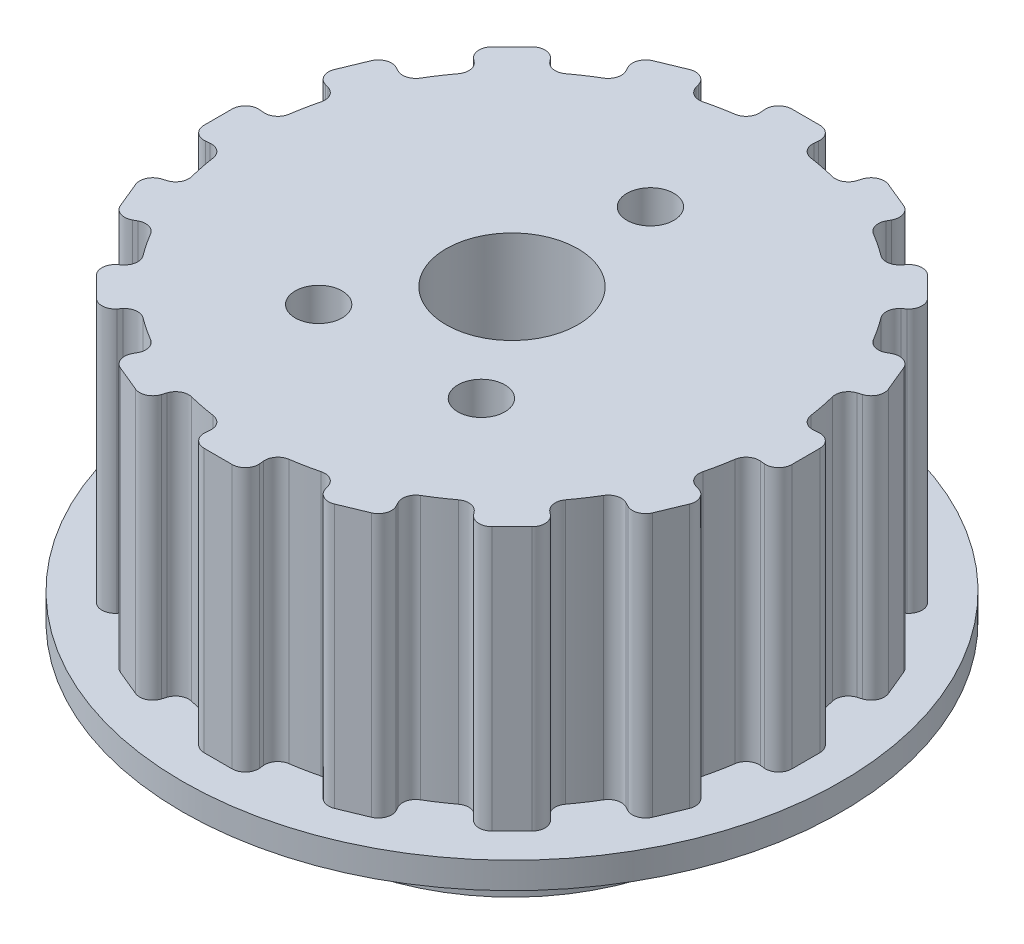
from build123d import *
from build123d.topology import SkipClean

# Parameters (mm, degrees)
SKETCH1_R               = 3.175
BOSS_EXTRUDE1_DEPTH     = 12.7
BOSS_EXTRUDE3_START     = 1.27
SKETCH3_R               = 15.875
SKETCH3_R_2             = 3.175
BOSS_EXTRUDE3_DEPTH     = 1.27
BOSS_EXTRUDE2_START     = 4.7625
SKETCH2_R               = 9.525
SKETCH2_R_2             = 3.175
BOSS_EXTRUDE2_DEPTH     = 4.7625
CUT_EXTRUDE1_DEPTH      = 26.793821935
CUT_EXTRUDE1_DEPTH_BACK = 26.793821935
SKETCH6_R               = 0.9921875
SKETCH7_R               = 1.1303
CUT_EXTRUDE2_DEPTH      = 5.588


with BuildPart() as part:
    # Sketch1 → Boss-Extrude1 (new body)
    with BuildSketch(Plane(origin=(0, 0, 0), x_dir=(1, 0, 0), z_dir=(0, 1, 0))):
        with BuildLine():
            Line((-0.674628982, 14.155289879), (0.674628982, 14.155289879))
            ThreePointArc((0.674628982, 14.155289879), (1.144835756, 13.947057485), (1.30665739, 13.458929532))
            Line((1.30665739, 13.458929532), (1.287105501, 13.25753972))
            ThreePointArc((1.287105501, 13.25753972), (1.419362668, 12.804447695), (1.82774658, 12.567789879))
            ThreePointArc((1.82774658, 12.567789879), (2.47764709, 12.455973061), (3.120867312, 12.310572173))
            ThreePointArc((3.120867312, 12.310572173), (3.588729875, 12.372933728), (3.884310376, 12.74092355))
            Line((3.884310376, 12.74092355), (3.943315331, 12.934465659))
            ThreePointArc((3.943315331, 12.934465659), (4.279617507, 13.323510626), (4.793719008, 13.33595193))
            Line((4.793719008, 13.33595193), (6.040270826, 12.819613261))
            ThreePointArc((6.040270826, 12.819613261), (6.394998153, 12.447291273), (6.357703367, 11.934393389))
            Line((6.357703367, 11.934393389), (6.262571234, 11.755815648))
            ThreePointArc((6.262571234, 11.755815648), (6.211370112, 11.286600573), (6.498102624, 10.911675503))
            ThreePointArc((6.498102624, 10.911675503), (7.055741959, 10.559664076), (7.594357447, 10.179181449))
            ThreePointArc((7.594357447, 10.179181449), (8.050470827, 10.057752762), (8.46437521, 10.284617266))
            Line((8.46437521, 10.284617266), (8.592954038, 10.44084664))
            ThreePointArc((8.592954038, 10.44084664), (9.052537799, 10.671580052), (9.532266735, 10.486336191))
            Line((9.532266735, 10.486336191), (10.486336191, 9.532266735))
            ThreePointArc((10.486336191, 9.532266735), (10.671580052, 9.052537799), (10.44084664, 8.592954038))
            Line((10.44084664, 8.592954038), (10.284617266, 8.46437521))
            ThreePointArc((10.284617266, 8.46437521), (10.057752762, 8.050470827), (10.179181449, 7.594357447))
            ThreePointArc((10.179181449, 7.594357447), (10.559664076, 7.055741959), (10.911675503, 6.498102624))
            ThreePointArc((10.911675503, 6.498102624), (11.286600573, 6.211370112), (11.755815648, 6.262571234))
            Line((11.755815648, 6.262571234), (11.934393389, 6.357703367))
            ThreePointArc((11.934393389, 6.357703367), (12.447291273, 6.394998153), (12.819613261, 6.040270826))
            Line((12.819613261, 6.040270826), (13.33595193, 4.793719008))
            ThreePointArc((13.33595193, 4.793719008), (13.323510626, 4.279617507), (12.934465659, 3.943315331))
            Line((12.934465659, 3.943315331), (12.74092355, 3.884310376))
            ThreePointArc((12.74092355, 3.884310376), (12.372933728, 3.588729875), (12.310572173, 3.120867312))
            ThreePointArc((12.310572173, 3.120867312), (12.455973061, 2.47764709), (12.567789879, 1.82774658))
            ThreePointArc((12.567789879, 1.82774658), (12.804447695, 1.419362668), (13.25753972, 1.287105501))
            Line((13.25753972, 1.287105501), (13.458929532, 1.30665739))
            ThreePointArc((13.458929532, 1.30665739), (13.947057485, 1.144835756), (14.155289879, 0.674628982))
            Line((14.155289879, 0.674628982), (14.155289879, -0.674628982))
            ThreePointArc((14.155289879, -0.674628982), (13.947057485, -1.144835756), (13.458929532, -1.30665739))
            Line((13.458929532, -1.30665739), (13.25753972, -1.287105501))
            ThreePointArc((13.25753972, -1.287105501), (12.804447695, -1.419362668), (12.567789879, -1.82774658))
            ThreePointArc((12.567789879, -1.82774658), (12.455973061, -2.47764709), (12.310572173, -3.120867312))
            ThreePointArc((12.310572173, -3.120867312), (12.372933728, -3.588729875), (12.74092355, -3.884310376))
            Line((12.74092355, -3.884310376), (12.934465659, -3.943315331))
            ThreePointArc((12.934465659, -3.943315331), (13.323510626, -4.279617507), (13.33595193, -4.793719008))
            Line((13.33595193, -4.793719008), (12.819613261, -6.040270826))
            ThreePointArc((12.819613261, -6.040270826), (12.447291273, -6.394998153), (11.934393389, -6.357703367))
            Line((11.934393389, -6.357703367), (11.755815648, -6.262571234))
            ThreePointArc((11.755815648, -6.262571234), (11.286600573, -6.211370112), (10.911675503, -6.498102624))
            ThreePointArc((10.911675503, -6.498102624), (10.559664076, -7.055741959), (10.179181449, -7.594357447))
            ThreePointArc((10.179181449, -7.594357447), (10.057752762, -8.050470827), (10.284617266, -8.46437521))
            Line((10.284617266, -8.46437521), (10.44084664, -8.592954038))
            ThreePointArc((10.44084664, -8.592954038), (10.671580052, -9.052537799), (10.486336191, -9.532266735))
            Line((10.486336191, -9.532266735), (9.532266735, -10.486336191))
            ThreePointArc((9.532266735, -10.486336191), (9.052537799, -10.671580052), (8.592954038, -10.44084664))
            Line((8.592954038, -10.44084664), (8.46437521, -10.284617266))
            ThreePointArc((8.46437521, -10.284617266), (8.050470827, -10.057752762), (7.594357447, -10.179181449))
            ThreePointArc((7.594357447, -10.179181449), (7.055741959, -10.559664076), (6.498102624, -10.911675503))
            ThreePointArc((6.498102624, -10.911675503), (6.211370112, -11.286600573), (6.262571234, -11.755815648))
            Line((6.262571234, -11.755815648), (6.357703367, -11.934393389))
            ThreePointArc((6.357703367, -11.934393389), (6.394998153, -12.447291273), (6.040270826, -12.819613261))
            Line((6.040270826, -12.819613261), (4.793719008, -13.33595193))
            ThreePointArc((4.793719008, -13.33595193), (4.279617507, -13.323510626), (3.943315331, -12.934465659))
            Line((3.943315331, -12.934465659), (3.884310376, -12.74092355))
            ThreePointArc((3.884310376, -12.74092355), (3.588729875, -12.372933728), (3.120867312, -12.310572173))
            ThreePointArc((3.120867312, -12.310572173), (2.47764709, -12.455973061), (1.82774658, -12.567789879))
            ThreePointArc((1.82774658, -12.567789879), (1.419362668, -12.804447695), (1.287105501, -13.25753972))
            Line((1.287105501, -13.25753972), (1.30665739, -13.458929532))
            ThreePointArc((1.30665739, -13.458929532), (1.144835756, -13.947057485), (0.674628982, -14.155289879))
            Line((0.674628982, -14.155289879), (-0.674628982, -14.155289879))
            ThreePointArc((-0.674628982, -14.155289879), (-1.144835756, -13.947057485), (-1.30665739, -13.458929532))
            Line((-1.30665739, -13.458929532), (-1.287105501, -13.25753972))
            ThreePointArc((-1.287105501, -13.25753972), (-1.419362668, -12.804447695), (-1.82774658, -12.567789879))
            ThreePointArc((-1.82774658, -12.567789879), (-2.47764709, -12.455973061), (-3.120867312, -12.310572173))
            ThreePointArc((-3.120867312, -12.310572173), (-3.588729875, -12.372933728), (-3.884310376, -12.74092355))
            Line((-3.884310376, -12.74092355), (-3.943315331, -12.934465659))
            ThreePointArc((-3.943315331, -12.934465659), (-4.279617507, -13.323510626), (-4.793719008, -13.33595193))
            Line((-4.793719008, -13.33595193), (-6.040270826, -12.819613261))
            ThreePointArc((-6.040270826, -12.819613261), (-6.394998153, -12.447291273), (-6.357703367, -11.934393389))
            Line((-6.357703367, -11.934393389), (-6.262571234, -11.755815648))
            ThreePointArc((-6.262571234, -11.755815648), (-6.211370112, -11.286600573), (-6.498102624, -10.911675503))
            ThreePointArc((-6.498102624, -10.911675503), (-7.055741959, -10.559664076), (-7.594357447, -10.179181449))
            ThreePointArc((-7.594357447, -10.179181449), (-8.050470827, -10.057752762), (-8.46437521, -10.284617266))
            Line((-8.46437521, -10.284617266), (-8.592954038, -10.44084664))
            ThreePointArc((-8.592954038, -10.44084664), (-9.052537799, -10.671580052), (-9.532266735, -10.486336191))
            Line((-9.532266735, -10.486336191), (-10.486336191, -9.532266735))
            ThreePointArc((-10.486336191, -9.532266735), (-10.671580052, -9.052537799), (-10.44084664, -8.592954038))
            Line((-10.44084664, -8.592954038), (-10.284617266, -8.46437521))
            ThreePointArc((-10.284617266, -8.46437521), (-10.057752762, -8.050470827), (-10.179181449, -7.594357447))
            ThreePointArc((-10.179181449, -7.594357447), (-10.559664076, -7.055741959), (-10.911675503, -6.498102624))
            ThreePointArc((-10.911675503, -6.498102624), (-11.286600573, -6.211370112), (-11.755815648, -6.262571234))
            Line((-11.755815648, -6.262571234), (-11.934393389, -6.357703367))
            ThreePointArc((-11.934393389, -6.357703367), (-12.447291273, -6.394998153), (-12.819613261, -6.040270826))
            Line((-12.819613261, -6.040270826), (-13.33595193, -4.793719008))
            ThreePointArc((-13.33595193, -4.793719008), (-13.323510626, -4.279617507), (-12.934465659, -3.943315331))
            Line((-12.934465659, -3.943315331), (-12.74092355, -3.884310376))
            ThreePointArc((-12.74092355, -3.884310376), (-12.372933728, -3.588729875), (-12.310572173, -3.120867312))
            ThreePointArc((-12.310572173, -3.120867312), (-12.455973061, -2.47764709), (-12.567789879, -1.82774658))
            ThreePointArc((-12.567789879, -1.82774658), (-12.804447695, -1.419362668), (-13.25753972, -1.287105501))
            Line((-13.25753972, -1.287105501), (-13.458929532, -1.30665739))
            ThreePointArc((-13.458929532, -1.30665739), (-13.947057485, -1.144835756), (-14.155289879, -0.674628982))
            Line((-14.155289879, -0.674628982), (-14.155289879, 0.674628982))
            ThreePointArc((-14.155289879, 0.674628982), (-13.947057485, 1.144835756), (-13.458929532, 1.30665739))
            Line((-13.458929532, 1.30665739), (-13.25753972, 1.287105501))
            ThreePointArc((-13.25753972, 1.287105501), (-12.804447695, 1.419362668), (-12.567789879, 1.82774658))
            ThreePointArc((-12.567789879, 1.82774658), (-12.455973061, 2.47764709), (-12.310572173, 3.120867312))
            ThreePointArc((-12.310572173, 3.120867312), (-12.372933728, 3.588729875), (-12.74092355, 3.884310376))
            Line((-12.74092355, 3.884310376), (-12.934465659, 3.943315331))
            ThreePointArc((-12.934465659, 3.943315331), (-13.323510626, 4.279617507), (-13.33595193, 4.793719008))
            Line((-13.33595193, 4.793719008), (-12.819613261, 6.040270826))
            ThreePointArc((-12.819613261, 6.040270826), (-12.447291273, 6.394998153), (-11.934393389, 6.357703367))
            Line((-11.934393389, 6.357703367), (-11.755815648, 6.262571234))
            ThreePointArc((-11.755815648, 6.262571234), (-11.286600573, 6.211370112), (-10.911675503, 6.498102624))
            ThreePointArc((-10.911675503, 6.498102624), (-10.559664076, 7.055741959), (-10.179181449, 7.594357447))
            ThreePointArc((-10.179181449, 7.594357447), (-10.057752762, 8.050470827), (-10.284617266, 8.46437521))
            Line((-10.284617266, 8.46437521), (-10.44084664, 8.592954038))
            ThreePointArc((-10.44084664, 8.592954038), (-10.671580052, 9.052537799), (-10.486336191, 9.532266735))
            Line((-10.486336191, 9.532266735), (-9.532266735, 10.486336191))
            ThreePointArc((-9.532266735, 10.486336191), (-9.052537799, 10.671580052), (-8.592954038, 10.44084664))
            Line((-8.592954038, 10.44084664), (-8.46437521, 10.284617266))
            ThreePointArc((-8.46437521, 10.284617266), (-8.050470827, 10.057752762), (-7.594357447, 10.179181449))
            ThreePointArc((-7.594357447, 10.179181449), (-7.055741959, 10.559664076), (-6.498102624, 10.911675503))
            ThreePointArc((-6.498102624, 10.911675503), (-6.211370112, 11.286600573), (-6.262571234, 11.755815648))
            Line((-6.262571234, 11.755815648), (-6.357703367, 11.934393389))
            ThreePointArc((-6.357703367, 11.934393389), (-6.394998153, 12.447291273), (-6.040270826, 12.819613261))
            Line((-6.040270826, 12.819613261), (-4.793719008, 13.33595193))
            ThreePointArc((-4.793719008, 13.33595193), (-4.279617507, 13.323510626), (-3.943315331, 12.934465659))
            Line((-3.943315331, 12.934465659), (-3.884310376, 12.74092355))
            ThreePointArc((-3.884310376, 12.74092355), (-3.588729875, 12.372933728), (-3.120867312, 12.310572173))
            ThreePointArc((-3.120867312, 12.310572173), (-2.47764709, 12.455973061), (-1.82774658, 12.567789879))
            ThreePointArc((-1.82774658, 12.567789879), (-1.419362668, 12.804447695), (-1.287105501, 13.25753972))
            Line((-1.287105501, 13.25753972), (-1.30665739, 13.458929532))
            ThreePointArc((-1.30665739, 13.458929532), (-1.144835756, 13.947057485), (-0.674628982, 14.155289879))
        make_face()
        with Locations(Location((0, 0, 0), (0, 0, 270))):
            Circle(SKETCH1_R, mode=Mode.SUBTRACT)
    extrude(amount=BOSS_EXTRUDE1_DEPTH)

    # Sketch3 → Boss-Extrude3 (add)
    with SkipClean():  # the faces are left unmerged after this step: merging them gives an invalid solid
        with BuildSketch(Plane.XZ.offset(BOSS_EXTRUDE3_START)):
            with Locations(Location((0, 0, 0), (0, 0, 270))):
                Circle(SKETCH3_R)
            with Locations(Location((0, 0, 0), (0, 0, 270))):
                Circle(SKETCH3_R_2, mode=Mode.SUBTRACT)
        extrude(amount=-BOSS_EXTRUDE3_DEPTH)

    # Sketch2 → Boss-Extrude2 (add)
    with SkipClean():  # the faces are left unmerged after this step: merging them gives an invalid solid
        with BuildSketch(Plane.XZ.offset(1.27).offset(BOSS_EXTRUDE2_START)):
            with Locations(Location((0, 0, 0), (0, 0, 90))):
                Circle(SKETCH2_R)
            with Locations(Location((0, 0, 0), (0, 0, 270))):
                Circle(SKETCH2_R_2, mode=Mode.SUBTRACT)
        extrude(amount=-BOSS_EXTRUDE2_DEPTH)

    # Sketch6 → Cut-Extrude1 (cut, two sides: drawn at the far end of the back side and taken through both)
    with SkipClean():  # the faces are left unmerged after this step: merging them gives an invalid solid
        with BuildSketch(Plane(origin=(0, 0, 0), x_dir=(0, 0, -1), z_dir=(1, 0, 0)).offset(-CUT_EXTRUDE1_DEPTH_BACK)):
            with Locations((0, -3.65125)):
                Circle(SKETCH6_R)
        extrude(amount=CUT_EXTRUDE1_DEPTH + CUT_EXTRUDE1_DEPTH_BACK, mode=Mode.SUBTRACT)

    # Sketch7 → Cut-Extrude2 (cut)
    with SkipClean():  # the faces are left unmerged after this step: merging them gives an invalid solid
        with BuildSketch(Plane(origin=(0, 12.7, 0), x_dir=(1, 0, 0), z_dir=(0, 1, 0))):
            with Locations(Location((0, 6.6675, 0), (0, 0, 270))):
                Circle(SKETCH7_R)
            with Locations(Location((3.91905817, -5.39412081, 0), (0, 0, 270))):
                Circle(SKETCH7_R)
            with Locations(Location((-3.91905817, -5.39412081, 0), (0, 0, 270))):
                Circle(SKETCH7_R)
        extrude(amount=-CUT_EXTRUDE2_DEPTH, mode=Mode.SUBTRACT)


solid = part.part
